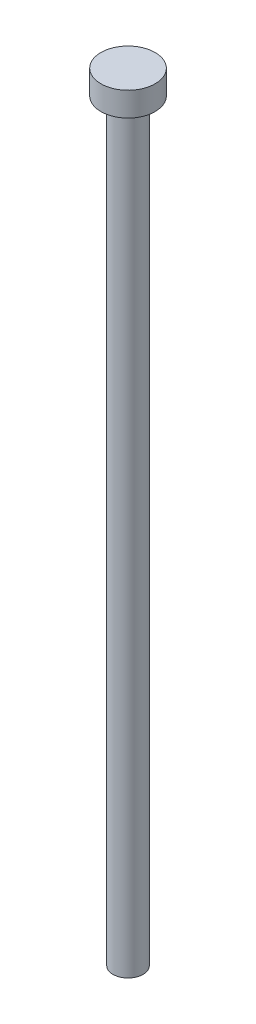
ISO-10303-21;
HEADER;
FILE_DESCRIPTION(('STEP AP214'),'2;1');
FILE_NAME('part.step','',(''),(''),'','','');
FILE_SCHEMA(('AUTOMOTIVE_DESIGN { 1 0 10303 214 1 1 1 1 }'));
ENDSEC;
DATA;
#1=APPLICATION_CONTEXT('core data for automotive mechanical design processes');
#2=APPLICATION_PROTOCOL_DEFINITION('international standard','automotive_design',2000,#1);
#3=PRODUCT_CONTEXT('',#1,'mechanical');
#4=PRODUCT('Part','Part','',(#3));
#5=PRODUCT_RELATED_PRODUCT_CATEGORY('part','',(#4));
#6=PRODUCT_DEFINITION_FORMATION('','',#4);
#7=PRODUCT_DEFINITION_CONTEXT('part definition',#1,'design');
#8=PRODUCT_DEFINITION('design','',#6,#7);
#9=PRODUCT_DEFINITION_SHAPE('','',#8);
#10=(LENGTH_UNIT() NAMED_UNIT(*) SI_UNIT(.MILLI.,.METRE.));
#11=(NAMED_UNIT(*) PLANE_ANGLE_UNIT() SI_UNIT($,.RADIAN.));
#12=(NAMED_UNIT(*) SI_UNIT($,.STERADIAN.) SOLID_ANGLE_UNIT());
#13=UNCERTAINTY_MEASURE_WITH_UNIT(LENGTH_MEASURE(1.E-05),#10,'distance_accuracy_value','');
#14=(GEOMETRIC_REPRESENTATION_CONTEXT(3) GLOBAL_UNCERTAINTY_ASSIGNED_CONTEXT((#13)) GLOBAL_UNIT_ASSIGNED_CONTEXT((#10,
#11,#12)) REPRESENTATION_CONTEXT('',''));
#15=CARTESIAN_POINT('',(0.,0.,0.));
#16=DIRECTION('',(0.,0.,1.));
#17=DIRECTION('',(1.,0.,0.));
#18=AXIS2_PLACEMENT_3D('',#15,#16,#17);
#19=CARTESIAN_POINT('',(1.27,0.,0.));
#20=DIRECTION('',(0.,-1.,0.));
#21=DIRECTION('',(1.,0.,0.));
#22=AXIS2_PLACEMENT_3D('',#19,#20,#21);
#23=PLANE('',#22);
#24=CARTESIAN_POINT('',(0.,0.,0.));
#25=DIRECTION('',(0.,-1.,0.));
#26=DIRECTION('',(1.,0.,0.));
#27=AXIS2_PLACEMENT_3D('',#24,#25,#26);
#28=CIRCLE('',#27,1.27);
#29=CARTESIAN_POINT('',(1.27,0.,0.));
#30=VERTEX_POINT('',#29);
#31=EDGE_CURVE('E49',#30,#30,#28,.T.);
#32=ORIENTED_EDGE('',*,*,#31,.T.);
#33=EDGE_LOOP('',(#32));
#34=FACE_BOUND('',#33,.T.);
#35=ADVANCED_FACE('F35',(#34),#23,.T.);
#36=CARTESIAN_POINT('',(0.,65.532,0.));
#37=DIRECTION('',(0.,1.,0.));
#38=DIRECTION('',(-1.,0.,0.));
#39=AXIS2_PLACEMENT_3D('',#36,#37,#38);
#40=PLANE('',#39);
#41=CARTESIAN_POINT('',(0.,65.532,0.));
#42=DIRECTION('',(0.,-1.,0.));
#43=DIRECTION('',(1.,0.,0.));
#44=AXIS2_PLACEMENT_3D('',#41,#42,#43);
#45=CIRCLE('',#44,2.286);
#46=CARTESIAN_POINT('',(2.286,65.532,0.));
#47=VERTEX_POINT('',#46);
#48=EDGE_CURVE('E10',#47,#47,#45,.T.);
#49=ORIENTED_EDGE('',*,*,#48,.F.);
#50=EDGE_LOOP('',(#49));
#51=FACE_BOUND('',#50,.T.);
#52=ADVANCED_FACE('F67',(#51),#40,.T.);
#53=CARTESIAN_POINT('',(0.,0.,0.));
#54=DIRECTION('',(0.,-1.,0.));
#55=DIRECTION('',(1.,0.,0.));
#56=AXIS2_PLACEMENT_3D('',#53,#54,#55);
#57=CYLINDRICAL_SURFACE('',#56,2.286);
#58=ORIENTED_EDGE('',*,*,#48,.T.);
#59=EDGE_LOOP('',(#58));
#60=FACE_BOUND('',#59,.T.);
#61=CARTESIAN_POINT('',(0.,63.5,0.));
#62=DIRECTION('',(0.,-1.,0.));
#63=DIRECTION('',(1.,0.,0.));
#64=AXIS2_PLACEMENT_3D('',#61,#62,#63);
#65=CIRCLE('',#64,2.286);
#66=CARTESIAN_POINT('',(2.286,63.5,0.));
#67=VERTEX_POINT('',#66);
#68=EDGE_CURVE('E41',#67,#67,#65,.T.);
#69=ORIENTED_EDGE('',*,*,#68,.F.);
#70=EDGE_LOOP('',(#69));
#71=FACE_BOUND('',#70,.T.);
#72=ADVANCED_FACE('F64',(#60,#71),#57,.T.);
#73=CARTESIAN_POINT('',(2.286,63.5,0.));
#74=DIRECTION('',(0.,-1.,0.));
#75=DIRECTION('',(1.,0.,0.));
#76=AXIS2_PLACEMENT_3D('',#73,#74,#75);
#77=PLANE('',#76);
#78=ORIENTED_EDGE('',*,*,#68,.T.);
#79=EDGE_LOOP('',(#78));
#80=FACE_BOUND('',#79,.T.);
#81=CARTESIAN_POINT('',(0.,63.5,0.));
#82=DIRECTION('',(0.,-1.,0.));
#83=DIRECTION('',(1.,0.,0.));
#84=AXIS2_PLACEMENT_3D('',#81,#82,#83);
#85=CIRCLE('',#84,1.26999999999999);
#86=CARTESIAN_POINT('',(1.26999999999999,63.5,0.));
#87=VERTEX_POINT('',#86);
#88=EDGE_CURVE('E45',#87,#87,#85,.T.);
#89=ORIENTED_EDGE('',*,*,#88,.F.);
#90=EDGE_LOOP('',(#89));
#91=FACE_BOUND('',#90,.T.);
#92=ADVANCED_FACE('F58',(#80,#91),#77,.T.);
#93=CARTESIAN_POINT('',(0.,0.,0.));
#94=DIRECTION('',(0.,-1.,0.));
#95=DIRECTION('',(1.,0.,0.));
#96=AXIS2_PLACEMENT_3D('',#93,#94,#95);
#97=CYLINDRICAL_SURFACE('',#96,1.27);
#98=ORIENTED_EDGE('',*,*,#88,.T.);
#99=EDGE_LOOP('',(#98));
#100=FACE_BOUND('',#99,.T.);
#101=ORIENTED_EDGE('',*,*,#31,.F.);
#102=EDGE_LOOP('',(#101));
#103=FACE_BOUND('',#102,.T.);
#104=ADVANCED_FACE('F56',(#100,#103),#97,.T.);
#105=CLOSED_SHELL('',(#35,#52,#72,#92,#104));
#106=MANIFOLD_SOLID_BREP('B2',#105);
#107=ADVANCED_BREP_SHAPE_REPRESENTATION('',(#18,#106),#14);
#108=SHAPE_DEFINITION_REPRESENTATION(#9,#107);
ENDSEC;
END-ISO-10303-21;
